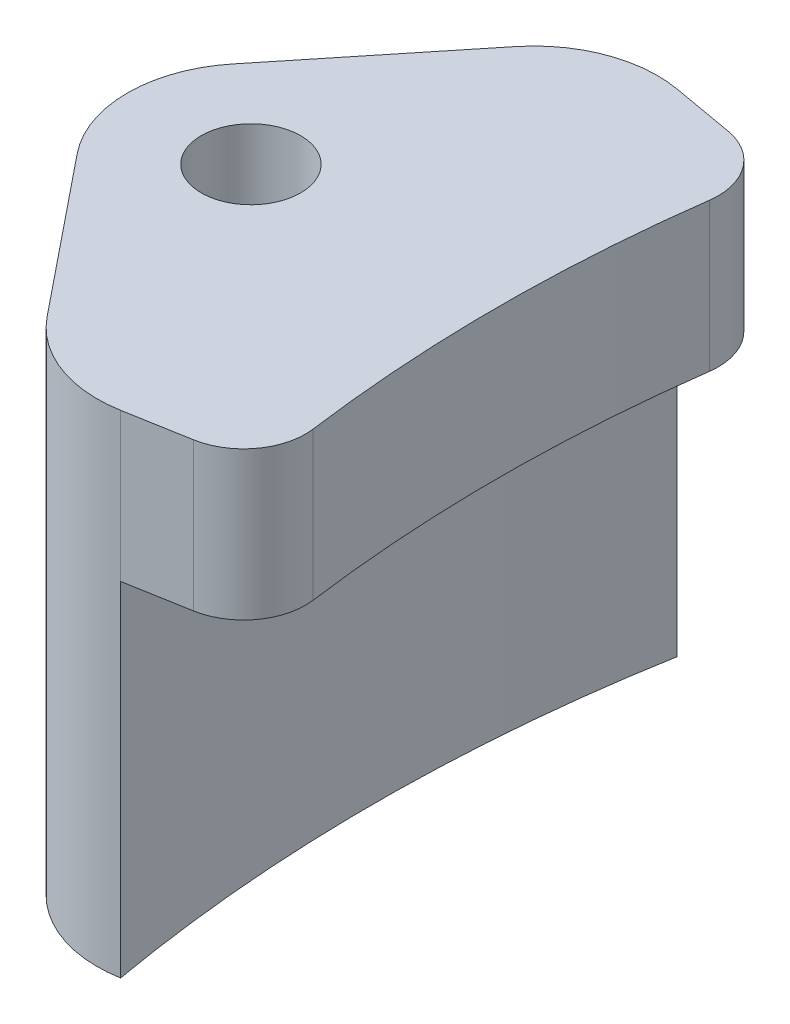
ISO-10303-21;
HEADER;
FILE_DESCRIPTION(('STEP AP214'),'2;1');
FILE_NAME('part.step','',(''),(''),'','','');
FILE_SCHEMA(('AUTOMOTIVE_DESIGN { 1 0 10303 214 1 1 1 1 }'));
ENDSEC;
DATA;
#1=APPLICATION_CONTEXT('core data for automotive mechanical design processes');
#2=APPLICATION_PROTOCOL_DEFINITION('international standard','automotive_design',2000,#1);
#3=PRODUCT_CONTEXT('',#1,'mechanical');
#4=PRODUCT('Part','Part','',(#3));
#5=PRODUCT_RELATED_PRODUCT_CATEGORY('part','',(#4));
#6=PRODUCT_DEFINITION_FORMATION('','',#4);
#7=PRODUCT_DEFINITION_CONTEXT('part definition',#1,'design');
#8=PRODUCT_DEFINITION('design','',#6,#7);
#9=PRODUCT_DEFINITION_SHAPE('','',#8);
#10=(LENGTH_UNIT() NAMED_UNIT(*) SI_UNIT(.MILLI.,.METRE.));
#11=(NAMED_UNIT(*) PLANE_ANGLE_UNIT() SI_UNIT($,.RADIAN.));
#12=(NAMED_UNIT(*) SI_UNIT($,.STERADIAN.) SOLID_ANGLE_UNIT());
#13=UNCERTAINTY_MEASURE_WITH_UNIT(LENGTH_MEASURE(1.E-05),#10,'distance_accuracy_value','');
#14=(GEOMETRIC_REPRESENTATION_CONTEXT(3) GLOBAL_UNCERTAINTY_ASSIGNED_CONTEXT((#13)) GLOBAL_UNIT_ASSIGNED_CONTEXT((#10,
#11,#12)) REPRESENTATION_CONTEXT('',''));
#15=CARTESIAN_POINT('',(0.,0.,0.));
#16=DIRECTION('',(0.,0.,1.));
#17=DIRECTION('',(1.,0.,0.));
#18=AXIS2_PLACEMENT_3D('',#15,#16,#17);
#19=CARTESIAN_POINT('',(0.,0.,0.));
#20=DIRECTION('',(0.173648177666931,0.,0.984807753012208));
#21=DIRECTION('',(0.984807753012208,0.,-0.173648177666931));
#22=AXIS2_PLACEMENT_3D('',#19,#20,#21);
#23=PLANE('',#22);
#24=DIRECTION('',(0.984807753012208,0.,-0.173648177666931));
#25=VECTOR('',#24,1.);
#26=CARTESIAN_POINT('',(-74.8559637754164,17.7800000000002,13.1991260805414));
#27=LINE('',#26,#25);
#28=CARTESIAN_POINT('',(-81.109493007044,17.7800000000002,14.3017920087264));
#29=VERTEX_POINT('',#28);
#30=CARTESIAN_POINT('',(-77.9200184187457,17.7800000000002,13.7394015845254));
#31=VERTEX_POINT('',#30);
#32=EDGE_CURVE('E187',#29,#31,#27,.T.);
#33=ORIENTED_EDGE('',*,*,#32,.T.);
#34=DIRECTION('',(0.,1.,0.));
#35=VECTOR('',#34,1.);
#36=CARTESIAN_POINT('',(-77.9200184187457,25.4000000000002,13.7394015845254));
#37=LINE('',#36,#35);
#38=CARTESIAN_POINT('',(-77.9200184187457,25.4000000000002,13.7394015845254));
#39=VERTEX_POINT('',#38);
#40=EDGE_CURVE('E11',#31,#39,#37,.T.);
#41=ORIENTED_EDGE('',*,*,#40,.T.);
#42=DIRECTION('',(-0.984807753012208,0.,0.173648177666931));
#43=VECTOR('',#42,1.);
#44=CARTESIAN_POINT('',(-74.8559637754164,25.4000000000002,13.1991260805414));
#45=LINE('',#44,#43);
#46=CARTESIAN_POINT('',(-81.109493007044,25.4000000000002,14.3017920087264));
#47=VERTEX_POINT('',#46);
#48=EDGE_CURVE('E189',#39,#47,#45,.T.);
#49=ORIENTED_EDGE('',*,*,#48,.T.);
#50=DIRECTION('',(0.,1.,0.));
#51=VECTOR('',#50,1.);
#52=CARTESIAN_POINT('',(-81.109493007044,0.126999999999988,14.3017920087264));
#53=LINE('',#52,#51);
#54=EDGE_CURVE('E205',#47,#29,#53,.F.);
#55=ORIENTED_EDGE('',*,*,#54,.T.);
#56=EDGE_LOOP('',(#33,#41,#49,#55));
#57=FACE_BOUND('',#56,.T.);
#58=ADVANCED_FACE('F35',(#57),#23,.T.);
#59=CARTESIAN_POINT('',(0.,0.,0.));
#60=DIRECTION('',(-0.173648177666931,0.,0.984807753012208));
#61=DIRECTION('',(0.984807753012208,0.,0.173648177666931));
#62=AXIS2_PLACEMENT_3D('',#59,#60,#61);
#63=PLANE('',#62);
#64=DIRECTION('',(-0.984807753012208,0.,-0.173648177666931));
#65=VECTOR('',#64,1.);
#66=CARTESIAN_POINT('',(-74.8559637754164,25.4000000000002,-13.1991260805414));
#67=LINE('',#66,#65);
#68=CARTESIAN_POINT('',(-77.9200184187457,25.4000000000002,-13.7394015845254));
#69=VERTEX_POINT('',#68);
#70=CARTESIAN_POINT('',(-81.109493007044,25.4000000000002,-14.3017920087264));
#71=VERTEX_POINT('',#70);
#72=EDGE_CURVE('E183',#69,#71,#67,.T.);
#73=ORIENTED_EDGE('',*,*,#72,.F.);
#74=DIRECTION('',(0.,-1.,0.));
#75=VECTOR('',#74,1.);
#76=CARTESIAN_POINT('',(-77.9200184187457,0.,-13.7394015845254));
#77=LINE('',#76,#75);
#78=CARTESIAN_POINT('',(-77.9200184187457,17.7800000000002,-13.7394015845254));
#79=VERTEX_POINT('',#78);
#80=EDGE_CURVE('E58',#69,#79,#77,.T.);
#81=ORIENTED_EDGE('',*,*,#80,.T.);
#82=DIRECTION('',(0.984807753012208,0.,0.173648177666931));
#83=VECTOR('',#82,1.);
#84=CARTESIAN_POINT('',(-74.8559637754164,17.7800000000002,-13.1991260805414));
#85=LINE('',#84,#83);
#86=CARTESIAN_POINT('',(-81.109493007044,17.7800000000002,-14.3017920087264));
#87=VERTEX_POINT('',#86);
#88=EDGE_CURVE('E181',#87,#79,#85,.T.);
#89=ORIENTED_EDGE('',*,*,#88,.F.);
#90=DIRECTION('',(0.,1.,0.));
#91=VECTOR('',#90,1.);
#92=CARTESIAN_POINT('',(-81.109493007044,0.126999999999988,-14.3017920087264));
#93=LINE('',#92,#91);
#94=EDGE_CURVE('E203',#71,#87,#93,.F.);
#95=ORIENTED_EDGE('',*,*,#94,.F.);
#96=EDGE_LOOP('',(#73,#81,#89,#95));
#97=FACE_BOUND('',#96,.T.);
#98=ADVANCED_FACE('F231',(#97),#63,.F.);
#99=CARTESIAN_POINT('',(-81.109493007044,0.126999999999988,14.3017920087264));
#100=DIRECTION('',(0.,1.,0.));
#101=DIRECTION('',(0.,0.,1.));
#102=AXIS2_PLACEMENT_3D('',#99,#100,#101);
#103=PLANE('',#102);
#104=CARTESIAN_POINT('',(0.,0.126999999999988,0.));
#105=DIRECTION('',(0.,-1.,0.));
#106=DIRECTION('',(0.,0.,-1.));
#107=AXIS2_PLACEMENT_3D('',#104,#105,#106);
#108=CIRCLE('',#107,82.3607376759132);
#109=CARTESIAN_POINT('',(-81.109493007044,0.126999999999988,14.3017920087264));
#110=VERTEX_POINT('',#109);
#111=CARTESIAN_POINT('',(-81.109493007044,0.126999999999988,-14.3017920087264));
#112=VERTEX_POINT('',#111);
#113=EDGE_CURVE('E200',#110,#112,#108,.T.);
#114=ORIENTED_EDGE('',*,*,#113,.F.);
#115=CARTESIAN_POINT('',(-82.212158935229,0.126999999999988,8.04826277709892));
#116=DIRECTION('',(0.,-1.,0.));
#117=DIRECTION('',(0.,0.,1.));
#118=AXIS2_PLACEMENT_3D('',#115,#116,#117);
#119=CIRCLE('',#118,6.35);
#120=CARTESIAN_POINT('',(-87.1526678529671,0.126999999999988,12.0374822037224));
#121=VERTEX_POINT('',#120);
#122=EDGE_CURVE('E151',#110,#121,#119,.T.);
#123=ORIENTED_EDGE('',*,*,#122,.T.);
#124=DIRECTION('',(-0.628223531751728,0.,-0.7780329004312));
#125=VECTOR('',#124,1.);
#126=CARTESIAN_POINT('',(-93.6512465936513,0.126999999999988,3.98921942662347));
#127=LINE('',#126,#125);
#128=CARTESIAN_POINT('',(-93.6512465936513,0.126999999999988,3.98921942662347));
#129=VERTEX_POINT('',#128);
#130=EDGE_CURVE('E133',#121,#129,#127,.T.);
#131=ORIENTED_EDGE('',*,*,#130,.T.);
#132=CARTESIAN_POINT('',(-88.7107376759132,0.126999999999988,0.));
#133=DIRECTION('',(0.,-1.,0.));
#134=DIRECTION('',(0.,0.,-1.));
#135=AXIS2_PLACEMENT_3D('',#132,#133,#134);
#136=CIRCLE('',#135,6.34999999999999);
#137=CARTESIAN_POINT('',(-93.6512465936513,0.126999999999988,-3.98921942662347));
#138=VERTEX_POINT('',#137);
#139=EDGE_CURVE('E123',#129,#138,#136,.T.);
#140=ORIENTED_EDGE('',*,*,#139,.T.);
#141=DIRECTION('',(0.628223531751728,0.,-0.7780329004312));
#142=VECTOR('',#141,1.);
#143=CARTESIAN_POINT('',(-93.6512465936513,0.126999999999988,-3.98921942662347));
#144=LINE('',#143,#142);
#145=CARTESIAN_POINT('',(-87.1526678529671,0.126999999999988,-12.0374822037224));
#146=VERTEX_POINT('',#145);
#147=EDGE_CURVE('E130',#138,#146,#144,.T.);
#148=ORIENTED_EDGE('',*,*,#147,.T.);
#149=CARTESIAN_POINT('',(-82.212158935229,0.126999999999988,-8.04826277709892));
#150=DIRECTION('',(0.,-1.,0.));
#151=DIRECTION('',(0.,0.,-1.));
#152=AXIS2_PLACEMENT_3D('',#149,#150,#151);
#153=CIRCLE('',#152,6.35);
#154=EDGE_CURVE('E149',#146,#112,#153,.T.);
#155=ORIENTED_EDGE('',*,*,#154,.T.);
#156=EDGE_LOOP('',(#114,#123,#131,#140,#148,#155));
#157=FACE_BOUND('',#156,.T.);
#158=CARTESIAN_POINT('',(-88.7107376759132,0.126999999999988,0.));
#159=DIRECTION('',(0.,-1.,0.));
#160=DIRECTION('',(0.,0.,-1.));
#161=AXIS2_PLACEMENT_3D('',#158,#159,#160);
#162=CIRCLE('',#161,2.55269999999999);
#163=CARTESIAN_POINT('',(-88.7107376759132,0.126999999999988,-2.55269999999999));
#164=VERTEX_POINT('',#163);
#165=EDGE_CURVE('E169',#164,#164,#162,.T.);
#166=ORIENTED_EDGE('',*,*,#165,.F.);
#167=EDGE_LOOP('',(#166));
#168=FACE_BOUND('',#167,.T.);
#169=ADVANCED_FACE('F126',(#157,#168),#103,.F.);
#170=CARTESIAN_POINT('',(0.,21.5546666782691,0.));
#171=DIRECTION('',(0.,-1.,0.));
#172=DIRECTION('',(0.,0.,-1.));
#173=AXIS2_PLACEMENT_3D('',#170,#171,#172);
#174=CYLINDRICAL_SURFACE('',#173,82.3607376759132);
#175=CARTESIAN_POINT('',(0.,17.7800000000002,0.));
#176=DIRECTION('',(0.,-1.,0.));
#177=DIRECTION('',(0.,0.,-1.));
#178=AXIS2_PLACEMENT_3D('',#175,#176,#177);
#179=CIRCLE('',#178,82.3607376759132);
#180=EDGE_CURVE('E197',#29,#87,#179,.T.);
#181=ORIENTED_EDGE('',*,*,#180,.F.);
#182=DIRECTION('',(0.,1.,0.));
#183=VECTOR('',#182,1.);
#184=CARTESIAN_POINT('',(-81.109493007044,17.7800000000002,14.3017920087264));
#185=LINE('',#184,#183);
#186=EDGE_CURVE('E185',#110,#29,#185,.T.);
#187=ORIENTED_EDGE('',*,*,#186,.F.);
#188=ORIENTED_EDGE('',*,*,#113,.T.);
#189=DIRECTION('',(0.,1.,0.));
#190=VECTOR('',#189,1.);
#191=CARTESIAN_POINT('',(-81.109493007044,17.7800000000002,-14.3017920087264));
#192=LINE('',#191,#190);
#193=EDGE_CURVE('E178',#112,#87,#192,.T.);
#194=ORIENTED_EDGE('',*,*,#193,.T.);
#195=EDGE_LOOP('',(#181,#187,#188,#194));
#196=FACE_BOUND('',#195,.T.);
#197=ADVANCED_FACE('F237',(#196),#174,.F.);
#198=CARTESIAN_POINT('',(-74.8559637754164,17.7800000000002,13.1991260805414));
#199=DIRECTION('',(0.,1.,0.));
#200=DIRECTION('',(0.,0.,1.));
#201=AXIS2_PLACEMENT_3D('',#198,#199,#200);
#202=PLANE('',#201);
#203=ORIENTED_EDGE('',*,*,#88,.T.);
#204=CARTESIAN_POINT('',(-78.4713513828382,17.7800000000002,-10.6126369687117));
#205=DIRECTION('',(0.,1.,0.));
#206=DIRECTION('',(0.,0.,1.));
#207=AXIS2_PLACEMENT_3D('',#204,#205,#206);
#208=CIRCLE('',#207,3.175);
#209=CARTESIAN_POINT('',(-75.3249951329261,17.7800000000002,-10.1871168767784));
#210=VERTEX_POINT('',#209);
#211=EDGE_CURVE('E43',#79,#210,#208,.F.);
#212=ORIENTED_EDGE('',*,*,#211,.T.);
#213=CARTESIAN_POINT('',(0.,17.7800000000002,0.));
#214=DIRECTION('',(0.,-1.,0.));
#215=DIRECTION('',(0.,0.,-1.));
#216=AXIS2_PLACEMENT_3D('',#213,#214,#215);
#217=CIRCLE('',#216,76.0107376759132);
#218=CARTESIAN_POINT('',(-75.3249951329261,17.7800000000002,10.1871168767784));
#219=VERTEX_POINT('',#218);
#220=EDGE_CURVE('E194',#219,#210,#217,.T.);
#221=ORIENTED_EDGE('',*,*,#220,.F.);
#222=CARTESIAN_POINT('',(-78.4713513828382,17.7800000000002,10.6126369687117));
#223=DIRECTION('',(0.,1.,0.));
#224=DIRECTION('',(0.,0.,1.));
#225=AXIS2_PLACEMENT_3D('',#222,#223,#224);
#226=CIRCLE('',#225,3.175);
#227=EDGE_CURVE('E50',#219,#31,#226,.F.);
#228=ORIENTED_EDGE('',*,*,#227,.T.);
#229=ORIENTED_EDGE('',*,*,#32,.F.);
#230=ORIENTED_EDGE('',*,*,#180,.T.);
#231=EDGE_LOOP('',(#203,#212,#221,#228,#229,#230));
#232=FACE_BOUND('',#231,.T.);
#233=ADVANCED_FACE('F219',(#232),#202,.F.);
#234=CARTESIAN_POINT('',(0.,21.5546666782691,0.));
#235=DIRECTION('',(0.,-1.,0.));
#236=DIRECTION('',(0.,0.,-1.));
#237=AXIS2_PLACEMENT_3D('',#234,#235,#236);
#238=CYLINDRICAL_SURFACE('',#237,76.0107376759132);
#239=ORIENTED_EDGE('',*,*,#220,.T.);
#240=DIRECTION('',(0.,-1.,0.));
#241=VECTOR('',#240,1.);
#242=CARTESIAN_POINT('',(-75.3249951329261,21.5546666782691,-10.1871168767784));
#243=LINE('',#242,#241);
#244=CARTESIAN_POINT('',(-75.3249951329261,25.4000000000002,-10.1871168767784));
#245=VERTEX_POINT('',#244);
#246=EDGE_CURVE('E210',#210,#245,#243,.F.);
#247=ORIENTED_EDGE('',*,*,#246,.T.);
#248=CARTESIAN_POINT('',(0.,25.4000000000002,0.));
#249=DIRECTION('',(0.,-1.,0.));
#250=DIRECTION('',(0.,0.,-1.));
#251=AXIS2_PLACEMENT_3D('',#248,#249,#250);
#252=CIRCLE('',#251,76.0107376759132);
#253=CARTESIAN_POINT('',(-75.3249951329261,25.4000000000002,10.1871168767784));
#254=VERTEX_POINT('',#253);
#255=EDGE_CURVE('E191',#254,#245,#252,.T.);
#256=ORIENTED_EDGE('',*,*,#255,.F.);
#257=DIRECTION('',(0.,-1.,0.));
#258=VECTOR('',#257,1.);
#259=CARTESIAN_POINT('',(-75.3249951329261,21.5546666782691,10.1871168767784));
#260=LINE('',#259,#258);
#261=EDGE_CURVE('E208',#254,#219,#260,.T.);
#262=ORIENTED_EDGE('',*,*,#261,.T.);
#263=EDGE_LOOP('',(#239,#247,#256,#262));
#264=FACE_BOUND('',#263,.T.);
#265=ADVANCED_FACE('F223',(#264),#238,.F.);
#266=CARTESIAN_POINT('',(-74.8559637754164,25.4000000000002,13.1991260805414));
#267=DIRECTION('',(0.,-1.,0.));
#268=DIRECTION('',(0.,0.,-1.));
#269=AXIS2_PLACEMENT_3D('',#266,#267,#268);
#270=PLANE('',#269);
#271=CARTESIAN_POINT('',(-88.7107376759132,25.4000000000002,0.));
#272=DIRECTION('',(0.,-1.,0.));
#273=DIRECTION('',(0.,0.,-1.));
#274=AXIS2_PLACEMENT_3D('',#271,#272,#273);
#275=CIRCLE('',#274,2.55269999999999);
#276=CARTESIAN_POINT('',(-88.7107376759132,25.4000000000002,-2.55269999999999));
#277=VERTEX_POINT('',#276);
#278=EDGE_CURVE('E175',#277,#277,#275,.T.);
#279=ORIENTED_EDGE('',*,*,#278,.T.);
#280=EDGE_LOOP('',(#279));
#281=FACE_BOUND('',#280,.T.);
#282=ORIENTED_EDGE('',*,*,#255,.T.);
#283=CARTESIAN_POINT('',(-78.4713513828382,25.4000000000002,-10.6126369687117));
#284=DIRECTION('',(0.,-1.,0.));
#285=DIRECTION('',(0.,0.,-1.));
#286=AXIS2_PLACEMENT_3D('',#283,#284,#285);
#287=CIRCLE('',#286,3.175);
#288=EDGE_CURVE('E215',#245,#69,#287,.F.);
#289=ORIENTED_EDGE('',*,*,#288,.T.);
#290=ORIENTED_EDGE('',*,*,#72,.T.);
#291=CARTESIAN_POINT('',(-82.212158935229,25.4000000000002,-8.04826277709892));
#292=DIRECTION('',(0.,-1.,0.));
#293=DIRECTION('',(0.,0.,-1.));
#294=AXIS2_PLACEMENT_3D('',#291,#292,#293);
#295=CIRCLE('',#294,6.35);
#296=CARTESIAN_POINT('',(-87.1526678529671,25.4000000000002,-12.0374822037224));
#297=VERTEX_POINT('',#296);
#298=EDGE_CURVE('E159',#297,#71,#295,.T.);
#299=ORIENTED_EDGE('',*,*,#298,.F.);
#300=DIRECTION('',(0.628223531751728,0.,-0.7780329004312));
#301=VECTOR('',#300,1.);
#302=CARTESIAN_POINT('',(-93.6512465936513,25.4000000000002,-3.98921942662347));
#303=LINE('',#302,#301);
#304=CARTESIAN_POINT('',(-93.6512465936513,25.4000000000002,-3.98921942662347));
#305=VERTEX_POINT('',#304);
#306=EDGE_CURVE('E157',#305,#297,#303,.T.);
#307=ORIENTED_EDGE('',*,*,#306,.F.);
#308=CARTESIAN_POINT('',(-88.7107376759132,25.4000000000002,0.));
#309=DIRECTION('',(0.,-1.,0.));
#310=DIRECTION('',(0.,0.,-1.));
#311=AXIS2_PLACEMENT_3D('',#308,#309,#310);
#312=CIRCLE('',#311,6.34999999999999);
#313=CARTESIAN_POINT('',(-93.6512465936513,25.4000000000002,3.98921942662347));
#314=VERTEX_POINT('',#313);
#315=EDGE_CURVE('E141',#314,#305,#312,.T.);
#316=ORIENTED_EDGE('',*,*,#315,.F.);
#317=DIRECTION('',(-0.628223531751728,0.,-0.7780329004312));
#318=VECTOR('',#317,1.);
#319=CARTESIAN_POINT('',(-93.6512465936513,25.4000000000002,3.98921942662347));
#320=LINE('',#319,#318);
#321=CARTESIAN_POINT('',(-87.1526678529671,25.4000000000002,12.0374822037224));
#322=VERTEX_POINT('',#321);
#323=EDGE_CURVE('E135',#322,#314,#320,.T.);
#324=ORIENTED_EDGE('',*,*,#323,.F.);
#325=CARTESIAN_POINT('',(-82.212158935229,25.4000000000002,8.04826277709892));
#326=DIRECTION('',(0.,-1.,0.));
#327=DIRECTION('',(0.,0.,1.));
#328=AXIS2_PLACEMENT_3D('',#325,#326,#327);
#329=CIRCLE('',#328,6.35);
#330=EDGE_CURVE('E162',#47,#322,#329,.T.);
#331=ORIENTED_EDGE('',*,*,#330,.F.);
#332=ORIENTED_EDGE('',*,*,#48,.F.);
#333=CARTESIAN_POINT('',(-78.4713513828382,25.4000000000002,10.6126369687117));
#334=DIRECTION('',(0.,-1.,0.));
#335=DIRECTION('',(0.,0.,-1.));
#336=AXIS2_PLACEMENT_3D('',#333,#334,#335);
#337=CIRCLE('',#336,3.175);
#338=EDGE_CURVE('E213',#39,#254,#337,.F.);
#339=ORIENTED_EDGE('',*,*,#338,.T.);
#340=EDGE_LOOP('',(#282,#289,#290,#299,#307,#316,#324,#331,#332,#339));
#341=FACE_BOUND('',#340,.T.);
#342=ADVANCED_FACE('F228',(#281,#341),#270,.F.);
#343=CARTESIAN_POINT('',(-88.7107376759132,0.126999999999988,0.));
#344=DIRECTION('',(0.,-1.,0.));
#345=DIRECTION('',(0.,0.,-1.));
#346=AXIS2_PLACEMENT_3D('',#343,#344,#345);
#347=CYLINDRICAL_SURFACE('',#346,2.55269999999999);
#348=ORIENTED_EDGE('',*,*,#278,.F.);
#349=EDGE_LOOP('',(#348));
#350=FACE_BOUND('',#349,.T.);
#351=ORIENTED_EDGE('',*,*,#165,.T.);
#352=EDGE_LOOP('',(#351));
#353=FACE_BOUND('',#352,.T.);
#354=ADVANCED_FACE('F263',(#350,#353),#347,.F.);
#355=CARTESIAN_POINT('',(-88.7107376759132,0.126999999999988,0.));
#356=DIRECTION('',(0.,1.,0.));
#357=DIRECTION('',(0.,0.,1.));
#358=AXIS2_PLACEMENT_3D('',#355,#356,#357);
#359=CYLINDRICAL_SURFACE('',#358,6.34999999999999);
#360=ORIENTED_EDGE('',*,*,#139,.F.);
#361=DIRECTION('',(0.,1.,0.));
#362=VECTOR('',#361,1.);
#363=CARTESIAN_POINT('',(-93.6512465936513,0.126999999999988,3.98921942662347));
#364=LINE('',#363,#362);
#365=EDGE_CURVE('E167',#129,#314,#364,.T.);
#366=ORIENTED_EDGE('',*,*,#365,.T.);
#367=ORIENTED_EDGE('',*,*,#315,.T.);
#368=DIRECTION('',(0.,1.,0.));
#369=VECTOR('',#368,1.);
#370=CARTESIAN_POINT('',(-93.6512465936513,0.126999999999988,-3.98921942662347));
#371=LINE('',#370,#369);
#372=EDGE_CURVE('E138',#138,#305,#371,.T.);
#373=ORIENTED_EDGE('',*,*,#372,.F.);
#374=EDGE_LOOP('',(#360,#366,#367,#373));
#375=FACE_BOUND('',#374,.T.);
#376=ADVANCED_FACE('F139',(#375),#359,.T.);
#377=CARTESIAN_POINT('',(-93.6512465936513,0.126999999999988,3.98921942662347));
#378=DIRECTION('',(0.7780329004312,0.,-0.628223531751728));
#379=DIRECTION('',(-0.628223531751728,0.,-0.7780329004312));
#380=AXIS2_PLACEMENT_3D('',#377,#378,#379);
#381=PLANE('',#380);
#382=ORIENTED_EDGE('',*,*,#323,.T.);
#383=ORIENTED_EDGE('',*,*,#365,.F.);
#384=ORIENTED_EDGE('',*,*,#130,.F.);
#385=DIRECTION('',(0.,1.,0.));
#386=VECTOR('',#385,1.);
#387=CARTESIAN_POINT('',(-87.1526678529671,0.126999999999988,12.0374822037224));
#388=LINE('',#387,#386);
#389=EDGE_CURVE('E170',#121,#322,#388,.T.);
#390=ORIENTED_EDGE('',*,*,#389,.T.);
#391=EDGE_LOOP('',(#382,#383,#384,#390));
#392=FACE_BOUND('',#391,.T.);
#393=ADVANCED_FACE('F242',(#392),#381,.F.);
#394=CARTESIAN_POINT('',(-82.212158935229,0.126999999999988,8.04826277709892));
#395=DIRECTION('',(0.,1.,0.));
#396=DIRECTION('',(0.,0.,1.));
#397=AXIS2_PLACEMENT_3D('',#394,#395,#396);
#398=CYLINDRICAL_SURFACE('',#397,6.35);
#399=ORIENTED_EDGE('',*,*,#330,.T.);
#400=ORIENTED_EDGE('',*,*,#389,.F.);
#401=ORIENTED_EDGE('',*,*,#122,.F.);
#402=ORIENTED_EDGE('',*,*,#186,.T.);
#403=ORIENTED_EDGE('',*,*,#54,.F.);
#404=EDGE_LOOP('',(#399,#400,#401,#402,#403));
#405=FACE_BOUND('',#404,.T.);
#406=ADVANCED_FACE('F245',(#405),#398,.T.);
#407=CARTESIAN_POINT('',(-82.212158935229,0.126999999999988,-8.04826277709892));
#408=DIRECTION('',(0.,1.,0.));
#409=DIRECTION('',(0.,0.,1.));
#410=AXIS2_PLACEMENT_3D('',#407,#408,#409);
#411=CYLINDRICAL_SURFACE('',#410,6.35);
#412=ORIENTED_EDGE('',*,*,#298,.T.);
#413=ORIENTED_EDGE('',*,*,#94,.T.);
#414=ORIENTED_EDGE('',*,*,#193,.F.);
#415=ORIENTED_EDGE('',*,*,#154,.F.);
#416=DIRECTION('',(0.,1.,0.));
#417=VECTOR('',#416,1.);
#418=CARTESIAN_POINT('',(-87.1526678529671,0.126999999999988,-12.0374822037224));
#419=LINE('',#418,#417);
#420=EDGE_CURVE('E145',#146,#297,#419,.T.);
#421=ORIENTED_EDGE('',*,*,#420,.T.);
#422=EDGE_LOOP('',(#412,#413,#414,#415,#421));
#423=FACE_BOUND('',#422,.T.);
#424=ADVANCED_FACE('F233',(#423),#411,.T.);
#425=CARTESIAN_POINT('',(-93.6512465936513,0.126999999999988,-3.98921942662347));
#426=DIRECTION('',(0.7780329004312,0.,0.628223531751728));
#427=DIRECTION('',(0.628223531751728,0.,-0.7780329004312));
#428=AXIS2_PLACEMENT_3D('',#425,#426,#427);
#429=PLANE('',#428);
#430=ORIENTED_EDGE('',*,*,#306,.T.);
#431=ORIENTED_EDGE('',*,*,#420,.F.);
#432=ORIENTED_EDGE('',*,*,#147,.F.);
#433=ORIENTED_EDGE('',*,*,#372,.T.);
#434=EDGE_LOOP('',(#430,#431,#432,#433));
#435=FACE_BOUND('',#434,.T.);
#436=ADVANCED_FACE('F147',(#435),#429,.F.);
#437=CARTESIAN_POINT('',(-78.4713513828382,21.5546666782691,-10.6126369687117));
#438=DIRECTION('',(0.,-1.,0.));
#439=DIRECTION('',(0.,0.,-1.));
#440=AXIS2_PLACEMENT_3D('',#437,#438,#439);
#441=CYLINDRICAL_SURFACE('',#440,3.175);
#442=ORIENTED_EDGE('',*,*,#211,.F.);
#443=ORIENTED_EDGE('',*,*,#80,.F.);
#444=ORIENTED_EDGE('',*,*,#288,.F.);
#445=ORIENTED_EDGE('',*,*,#246,.F.);
#446=EDGE_LOOP('',(#442,#443,#444,#445));
#447=FACE_BOUND('',#446,.T.);
#448=ADVANCED_FACE('F226',(#447),#441,.T.);
#449=CARTESIAN_POINT('',(-78.4713513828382,21.5546666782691,10.6126369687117));
#450=DIRECTION('',(0.,-1.,0.));
#451=DIRECTION('',(0.,0.,-1.));
#452=AXIS2_PLACEMENT_3D('',#449,#450,#451);
#453=CYLINDRICAL_SURFACE('',#452,3.175);
#454=ORIENTED_EDGE('',*,*,#227,.F.);
#455=ORIENTED_EDGE('',*,*,#261,.F.);
#456=ORIENTED_EDGE('',*,*,#338,.F.);
#457=ORIENTED_EDGE('',*,*,#40,.F.);
#458=EDGE_LOOP('',(#454,#455,#456,#457));
#459=FACE_BOUND('',#458,.T.);
#460=ADVANCED_FACE('F37',(#459),#453,.T.);
#461=CLOSED_SHELL('',(#58,#98,#169,#197,#233,#265,#342,#354,#376,#393,#406,#424,#436,#448,#460));
#462=MANIFOLD_SOLID_BREP('B2',#461);
#463=ADVANCED_BREP_SHAPE_REPRESENTATION('',(#18,#462),#14);
#464=SHAPE_DEFINITION_REPRESENTATION(#9,#463);
ENDSEC;
END-ISO-10303-21;
